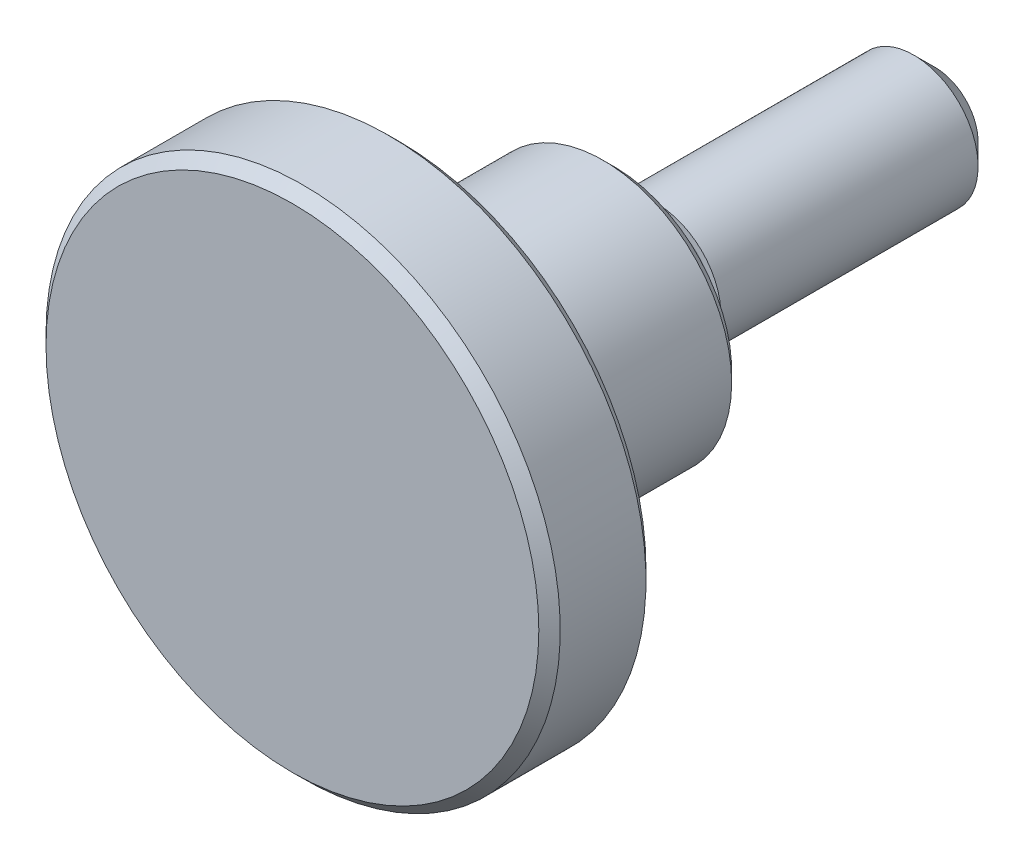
ISO-10303-21;
HEADER;
FILE_DESCRIPTION(('STEP AP214'),'2;1');
FILE_NAME('part.step','',(''),(''),'','','');
FILE_SCHEMA(('AUTOMOTIVE_DESIGN { 1 0 10303 214 1 1 1 1 }'));
ENDSEC;
DATA;
#1=APPLICATION_CONTEXT('core data for automotive mechanical design processes');
#2=APPLICATION_PROTOCOL_DEFINITION('international standard','automotive_design',2000,#1);
#3=PRODUCT_CONTEXT('',#1,'mechanical');
#4=PRODUCT('Part','Part','',(#3));
#5=PRODUCT_RELATED_PRODUCT_CATEGORY('part','',(#4));
#6=PRODUCT_DEFINITION_FORMATION('','',#4);
#7=PRODUCT_DEFINITION_CONTEXT('part definition',#1,'design');
#8=PRODUCT_DEFINITION('design','',#6,#7);
#9=PRODUCT_DEFINITION_SHAPE('','',#8);
#10=(LENGTH_UNIT() NAMED_UNIT(*) SI_UNIT(.MILLI.,.METRE.));
#11=(NAMED_UNIT(*) PLANE_ANGLE_UNIT() SI_UNIT($,.RADIAN.));
#12=(NAMED_UNIT(*) SI_UNIT($,.STERADIAN.) SOLID_ANGLE_UNIT());
#13=UNCERTAINTY_MEASURE_WITH_UNIT(LENGTH_MEASURE(1.E-05),#10,'distance_accuracy_value','');
#14=(GEOMETRIC_REPRESENTATION_CONTEXT(3) GLOBAL_UNCERTAINTY_ASSIGNED_CONTEXT((#13)) GLOBAL_UNIT_ASSIGNED_CONTEXT((#10,
#11,#12)) REPRESENTATION_CONTEXT('',''));
#15=CARTESIAN_POINT('',(0.,0.,0.));
#16=DIRECTION('',(0.,0.,1.));
#17=DIRECTION('',(1.,0.,0.));
#18=AXIS2_PLACEMENT_3D('',#15,#16,#17);
#19=CARTESIAN_POINT('',(0.,2.,-15.));
#20=DIRECTION('',(0.,0.,-1.));
#21=DIRECTION('',(-1.,0.,0.));
#22=AXIS2_PLACEMENT_3D('',#19,#20,#21);
#23=PLANE('',#22);
#24=CARTESIAN_POINT('',(0.,0.,-15.));
#25=DIRECTION('',(0.,0.,-1.));
#26=DIRECTION('',(-1.,0.,0.));
#27=AXIS2_PLACEMENT_3D('',#24,#25,#26);
#28=CIRCLE('',#27,2.);
#29=CARTESIAN_POINT('',(-2.,0.,-15.));
#30=VERTEX_POINT('',#29);
#31=EDGE_CURVE('E8',#30,#30,#28,.T.);
#32=ORIENTED_EDGE('',*,*,#31,.T.);
#33=EDGE_LOOP('',(#32));
#34=FACE_BOUND('',#33,.T.);
#35=ADVANCED_FACE('F12',(#34),#23,.T.);
#36=CARTESIAN_POINT('',(0.,0.,-15.));
#37=DIRECTION('',(0.,0.,1.));
#38=DIRECTION('',(1.,0.,0.));
#39=AXIS2_PLACEMENT_3D('',#36,#37,#38);
#40=CONICAL_SURFACE('',#39,2.,0.785398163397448);
#41=CARTESIAN_POINT('',(0.,0.,-14.));
#42=DIRECTION('',(0.,0.,-1.));
#43=DIRECTION('',(-1.,0.,0.));
#44=AXIS2_PLACEMENT_3D('',#41,#42,#43);
#45=CIRCLE('',#44,3.);
#46=CARTESIAN_POINT('',(-3.,0.,-14.));
#47=VERTEX_POINT('',#46);
#48=EDGE_CURVE('E18',#47,#47,#45,.T.);
#49=ORIENTED_EDGE('',*,*,#48,.T.);
#50=EDGE_LOOP('',(#49));
#51=FACE_BOUND('',#50,.T.);
#52=ORIENTED_EDGE('',*,*,#31,.F.);
#53=EDGE_LOOP('',(#52));
#54=FACE_BOUND('',#53,.T.);
#55=ADVANCED_FACE('F79',(#51,#54),#40,.T.);
#56=CARTESIAN_POINT('',(0.,0.,-17.5));
#57=DIRECTION('',(0.,0.,-1.));
#58=DIRECTION('',(-1.,0.,0.));
#59=AXIS2_PLACEMENT_3D('',#56,#57,#58);
#60=CYLINDRICAL_SURFACE('',#59,3.);
#61=CARTESIAN_POINT('',(0.,0.,-2.));
#62=DIRECTION('',(0.,0.,-1.));
#63=DIRECTION('',(-1.,0.,0.));
#64=AXIS2_PLACEMENT_3D('',#61,#62,#63);
#65=CIRCLE('',#64,3.);
#66=CARTESIAN_POINT('',(-3.,0.,-2.));
#67=VERTEX_POINT('',#66);
#68=EDGE_CURVE('E22',#67,#67,#65,.T.);
#69=ORIENTED_EDGE('',*,*,#68,.T.);
#70=EDGE_LOOP('',(#69));
#71=FACE_BOUND('',#70,.T.);
#72=ORIENTED_EDGE('',*,*,#48,.F.);
#73=EDGE_LOOP('',(#72));
#74=FACE_BOUND('',#73,.T.);
#75=ADVANCED_FACE('F84',(#71,#74),#60,.T.);
#76=CARTESIAN_POINT('',(0.,3.,-2.));
#77=DIRECTION('',(0.,0.,1.));
#78=DIRECTION('',(1.,0.,0.));
#79=AXIS2_PLACEMENT_3D('',#76,#77,#78);
#80=PLANE('',#79);
#81=CARTESIAN_POINT('',(0.,0.,-2.));
#82=DIRECTION('',(0.,0.,-1.));
#83=DIRECTION('',(-1.,0.,0.));
#84=AXIS2_PLACEMENT_3D('',#81,#82,#83);
#85=CIRCLE('',#84,2.7);
#86=CARTESIAN_POINT('',(-2.7,0.,-2.));
#87=VERTEX_POINT('',#86);
#88=EDGE_CURVE('E26',#87,#87,#85,.T.);
#89=ORIENTED_EDGE('',*,*,#88,.T.);
#90=EDGE_LOOP('',(#89));
#91=FACE_BOUND('',#90,.T.);
#92=ORIENTED_EDGE('',*,*,#68,.F.);
#93=EDGE_LOOP('',(#92));
#94=FACE_BOUND('',#93,.T.);
#95=ADVANCED_FACE('F89',(#91,#94),#80,.T.);
#96=CARTESIAN_POINT('',(0.,0.,-1.5));
#97=DIRECTION('',(0.,0.,-1.));
#98=DIRECTION('',(-1.,0.,0.));
#99=AXIS2_PLACEMENT_3D('',#96,#97,#98);
#100=TOROIDAL_SURFACE('',#99,2.7,0.5);
#101=CARTESIAN_POINT('',(0.,0.,-1.5));
#102=DIRECTION('',(0.,0.,-1.));
#103=DIRECTION('',(-1.,0.,0.));
#104=AXIS2_PLACEMENT_3D('',#101,#102,#103);
#105=CIRCLE('',#104,2.2);
#106=CARTESIAN_POINT('',(-2.2,0.,-1.5));
#107=VERTEX_POINT('',#106);
#108=EDGE_CURVE('E31',#107,#107,#105,.T.);
#109=ORIENTED_EDGE('',*,*,#108,.T.);
#110=EDGE_LOOP('',(#109));
#111=FACE_BOUND('',#110,.T.);
#112=ORIENTED_EDGE('',*,*,#88,.F.);
#113=EDGE_LOOP('',(#112));
#114=FACE_BOUND('',#113,.T.);
#115=ADVANCED_FACE('F96',(#111,#114),#100,.F.);
#116=CARTESIAN_POINT('',(0.,0.,-17.5));
#117=DIRECTION('',(0.,0.,-1.));
#118=DIRECTION('',(-1.,0.,0.));
#119=AXIS2_PLACEMENT_3D('',#116,#117,#118);
#120=CYLINDRICAL_SURFACE('',#119,2.2);
#121=CARTESIAN_POINT('',(0.,0.,-0.5));
#122=DIRECTION('',(0.,0.,-1.));
#123=DIRECTION('',(-1.,0.,0.));
#124=AXIS2_PLACEMENT_3D('',#121,#122,#123);
#125=CIRCLE('',#124,2.2);
#126=CARTESIAN_POINT('',(-2.2,0.,-0.5));
#127=VERTEX_POINT('',#126);
#128=EDGE_CURVE('E34',#127,#127,#125,.T.);
#129=ORIENTED_EDGE('',*,*,#128,.T.);
#130=EDGE_LOOP('',(#129));
#131=FACE_BOUND('',#130,.T.);
#132=ORIENTED_EDGE('',*,*,#108,.F.);
#133=EDGE_LOOP('',(#132));
#134=FACE_BOUND('',#133,.T.);
#135=ADVANCED_FACE('F100',(#131,#134),#120,.T.);
#136=CARTESIAN_POINT('',(0.,0.,-0.5));
#137=DIRECTION('',(0.,0.,-1.));
#138=DIRECTION('',(-1.,0.,0.));
#139=AXIS2_PLACEMENT_3D('',#136,#137,#138);
#140=TOROIDAL_SURFACE('',#139,2.7,0.5);
#141=CARTESIAN_POINT('',(0.,0.,0.));
#142=DIRECTION('',(0.,0.,-1.));
#143=DIRECTION('',(-1.,0.,0.));
#144=AXIS2_PLACEMENT_3D('',#141,#142,#143);
#145=CIRCLE('',#144,2.7);
#146=CARTESIAN_POINT('',(-2.7,0.,0.));
#147=VERTEX_POINT('',#146);
#148=EDGE_CURVE('E37',#147,#147,#145,.T.);
#149=ORIENTED_EDGE('',*,*,#148,.T.);
#150=EDGE_LOOP('',(#149));
#151=FACE_BOUND('',#150,.T.);
#152=ORIENTED_EDGE('',*,*,#128,.F.);
#153=EDGE_LOOP('',(#152));
#154=FACE_BOUND('',#153,.T.);
#155=ADVANCED_FACE('F104',(#151,#154),#140,.F.);
#156=CARTESIAN_POINT('',(0.,5.5,0.));
#157=DIRECTION('',(0.,0.,-1.));
#158=DIRECTION('',(-1.,0.,0.));
#159=AXIS2_PLACEMENT_3D('',#156,#157,#158);
#160=PLANE('',#159);
#161=CARTESIAN_POINT('',(0.,0.,0.));
#162=DIRECTION('',(0.,0.,-1.));
#163=DIRECTION('',(-1.,0.,0.));
#164=AXIS2_PLACEMENT_3D('',#161,#162,#163);
#165=CIRCLE('',#164,5.5);
#166=CARTESIAN_POINT('',(-5.5,0.,0.));
#167=VERTEX_POINT('',#166);
#168=EDGE_CURVE('E40',#167,#167,#165,.T.);
#169=ORIENTED_EDGE('',*,*,#168,.T.);
#170=EDGE_LOOP('',(#169));
#171=FACE_BOUND('',#170,.T.);
#172=ORIENTED_EDGE('',*,*,#148,.F.);
#173=EDGE_LOOP('',(#172));
#174=FACE_BOUND('',#173,.T.);
#175=ADVANCED_FACE('F108',(#171,#174),#160,.T.);
#176=CARTESIAN_POINT('',(0.,0.,0.));
#177=DIRECTION('',(0.,0.,1.));
#178=DIRECTION('',(1.,0.,0.));
#179=AXIS2_PLACEMENT_3D('',#176,#177,#178);
#180=CONICAL_SURFACE('',#179,5.5,0.785398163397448);
#181=CARTESIAN_POINT('',(0.,0.,0.5));
#182=DIRECTION('',(0.,0.,-1.));
#183=DIRECTION('',(-1.,0.,0.));
#184=AXIS2_PLACEMENT_3D('',#181,#182,#183);
#185=CIRCLE('',#184,6.);
#186=CARTESIAN_POINT('',(-6.,0.,0.5));
#187=VERTEX_POINT('',#186);
#188=EDGE_CURVE('E43',#187,#187,#185,.T.);
#189=ORIENTED_EDGE('',*,*,#188,.T.);
#190=EDGE_LOOP('',(#189));
#191=FACE_BOUND('',#190,.T.);
#192=ORIENTED_EDGE('',*,*,#168,.F.);
#193=EDGE_LOOP('',(#192));
#194=FACE_BOUND('',#193,.T.);
#195=ADVANCED_FACE('F112',(#191,#194),#180,.T.);
#196=CARTESIAN_POINT('',(0.,0.,-17.5));
#197=DIRECTION('',(0.,0.,-1.));
#198=DIRECTION('',(-1.,0.,0.));
#199=AXIS2_PLACEMENT_3D('',#196,#197,#198);
#200=CYLINDRICAL_SURFACE('',#199,6.);
#201=CARTESIAN_POINT('',(0.,0.,9.));
#202=DIRECTION('',(0.,0.,-1.));
#203=DIRECTION('',(-1.,0.,0.));
#204=AXIS2_PLACEMENT_3D('',#201,#202,#203);
#205=CIRCLE('',#204,6.);
#206=CARTESIAN_POINT('',(-6.,0.,9.));
#207=VERTEX_POINT('',#206);
#208=EDGE_CURVE('E46',#207,#207,#205,.T.);
#209=ORIENTED_EDGE('',*,*,#208,.T.);
#210=EDGE_LOOP('',(#209));
#211=FACE_BOUND('',#210,.T.);
#212=ORIENTED_EDGE('',*,*,#188,.F.);
#213=EDGE_LOOP('',(#212));
#214=FACE_BOUND('',#213,.T.);
#215=ADVANCED_FACE('F116',(#211,#214),#200,.T.);
#216=CARTESIAN_POINT('',(0.,0.,9.));
#217=DIRECTION('',(0.,0.,-1.));
#218=DIRECTION('',(-1.,0.,0.));
#219=AXIS2_PLACEMENT_3D('',#216,#217,#218);
#220=TOROIDAL_SURFACE('',#219,7.,1.);
#221=CARTESIAN_POINT('',(0.,0.,10.));
#222=DIRECTION('',(0.,0.,-1.));
#223=DIRECTION('',(-1.,0.,0.));
#224=AXIS2_PLACEMENT_3D('',#221,#222,#223);
#225=CIRCLE('',#224,7.);
#226=CARTESIAN_POINT('',(-7.,0.,10.));
#227=VERTEX_POINT('',#226);
#228=EDGE_CURVE('E49',#227,#227,#225,.T.);
#229=ORIENTED_EDGE('',*,*,#228,.T.);
#230=EDGE_LOOP('',(#229));
#231=FACE_BOUND('',#230,.T.);
#232=ORIENTED_EDGE('',*,*,#208,.F.);
#233=EDGE_LOOP('',(#232));
#234=FACE_BOUND('',#233,.T.);
#235=ADVANCED_FACE('F120',(#231,#234),#220,.F.);
#236=CARTESIAN_POINT('',(0.,11.5,10.));
#237=DIRECTION('',(0.,0.,-1.));
#238=DIRECTION('',(-1.,0.,0.));
#239=AXIS2_PLACEMENT_3D('',#236,#237,#238);
#240=PLANE('',#239);
#241=CARTESIAN_POINT('',(0.,0.,10.));
#242=DIRECTION('',(0.,0.,-1.));
#243=DIRECTION('',(-1.,0.,0.));
#244=AXIS2_PLACEMENT_3D('',#241,#242,#243);
#245=CIRCLE('',#244,11.5);
#246=CARTESIAN_POINT('',(-11.5,0.,10.));
#247=VERTEX_POINT('',#246);
#248=EDGE_CURVE('E52',#247,#247,#245,.T.);
#249=ORIENTED_EDGE('',*,*,#248,.T.);
#250=EDGE_LOOP('',(#249));
#251=FACE_BOUND('',#250,.T.);
#252=ORIENTED_EDGE('',*,*,#228,.F.);
#253=EDGE_LOOP('',(#252));
#254=FACE_BOUND('',#253,.T.);
#255=ADVANCED_FACE('F124',(#251,#254),#240,.T.);
#256=CARTESIAN_POINT('',(0.,0.,10.));
#257=DIRECTION('',(0.,0.,1.));
#258=DIRECTION('',(1.,0.,0.));
#259=AXIS2_PLACEMENT_3D('',#256,#257,#258);
#260=CONICAL_SURFACE('',#259,11.5,0.785398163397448);
#261=CARTESIAN_POINT('',(0.,0.,10.5));
#262=DIRECTION('',(0.,0.,-1.));
#263=DIRECTION('',(-1.,0.,0.));
#264=AXIS2_PLACEMENT_3D('',#261,#262,#263);
#265=CIRCLE('',#264,12.);
#266=CARTESIAN_POINT('',(-12.,0.,10.5));
#267=VERTEX_POINT('',#266);
#268=EDGE_CURVE('E55',#267,#267,#265,.T.);
#269=ORIENTED_EDGE('',*,*,#268,.T.);
#270=EDGE_LOOP('',(#269));
#271=FACE_BOUND('',#270,.T.);
#272=ORIENTED_EDGE('',*,*,#248,.F.);
#273=EDGE_LOOP('',(#272));
#274=FACE_BOUND('',#273,.T.);
#275=ADVANCED_FACE('F128',(#271,#274),#260,.T.);
#276=CARTESIAN_POINT('',(0.,0.,-17.5));
#277=DIRECTION('',(0.,0.,-1.));
#278=DIRECTION('',(-1.,0.,0.));
#279=AXIS2_PLACEMENT_3D('',#276,#277,#278);
#280=CYLINDRICAL_SURFACE('',#279,12.);
#281=CARTESIAN_POINT('',(0.,0.,14.5));
#282=DIRECTION('',(0.,0.,-1.));
#283=DIRECTION('',(-1.,0.,0.));
#284=AXIS2_PLACEMENT_3D('',#281,#282,#283);
#285=CIRCLE('',#284,12.);
#286=CARTESIAN_POINT('',(-12.,0.,14.5));
#287=VERTEX_POINT('',#286);
#288=EDGE_CURVE('E58',#287,#287,#285,.T.);
#289=ORIENTED_EDGE('',*,*,#288,.T.);
#290=EDGE_LOOP('',(#289));
#291=FACE_BOUND('',#290,.T.);
#292=ORIENTED_EDGE('',*,*,#268,.F.);
#293=EDGE_LOOP('',(#292));
#294=FACE_BOUND('',#293,.T.);
#295=ADVANCED_FACE('F76',(#291,#294),#280,.T.);
#296=CARTESIAN_POINT('',(0.,0.,14.5));
#297=DIRECTION('',(0.,0.,-1.));
#298=DIRECTION('',(-1.,0.,0.));
#299=AXIS2_PLACEMENT_3D('',#296,#297,#298);
#300=CONICAL_SURFACE('',#299,12.,0.785398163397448);
#301=CARTESIAN_POINT('',(0.,0.,15.));
#302=DIRECTION('',(0.,0.,-1.));
#303=DIRECTION('',(-1.,0.,0.));
#304=AXIS2_PLACEMENT_3D('',#301,#302,#303);
#305=CIRCLE('',#304,11.5);
#306=CARTESIAN_POINT('',(-11.5,0.,15.));
#307=VERTEX_POINT('',#306);
#308=EDGE_CURVE('E61',#307,#307,#305,.T.);
#309=ORIENTED_EDGE('',*,*,#308,.T.);
#310=EDGE_LOOP('',(#309));
#311=FACE_BOUND('',#310,.T.);
#312=ORIENTED_EDGE('',*,*,#288,.F.);
#313=EDGE_LOOP('',(#312));
#314=FACE_BOUND('',#313,.T.);
#315=ADVANCED_FACE('F65',(#311,#314),#300,.T.);
#316=CARTESIAN_POINT('',(0.,11.5,15.));
#317=DIRECTION('',(0.,0.,1.));
#318=DIRECTION('',(1.,0.,0.));
#319=AXIS2_PLACEMENT_3D('',#316,#317,#318);
#320=PLANE('',#319);
#321=ORIENTED_EDGE('',*,*,#308,.F.);
#322=EDGE_LOOP('',(#321));
#323=FACE_BOUND('',#322,.T.);
#324=ADVANCED_FACE('F68',(#323),#320,.T.);
#325=CLOSED_SHELL('',(#35,#55,#75,#95,#115,#135,#155,#175,#195,#215,#235,#255,#275,#295,#315,#324));
#326=MANIFOLD_SOLID_BREP('B1',#325);
#327=ADVANCED_BREP_SHAPE_REPRESENTATION('',(#18,#326),#14);
#328=SHAPE_DEFINITION_REPRESENTATION(#9,#327);
ENDSEC;
END-ISO-10303-21;
